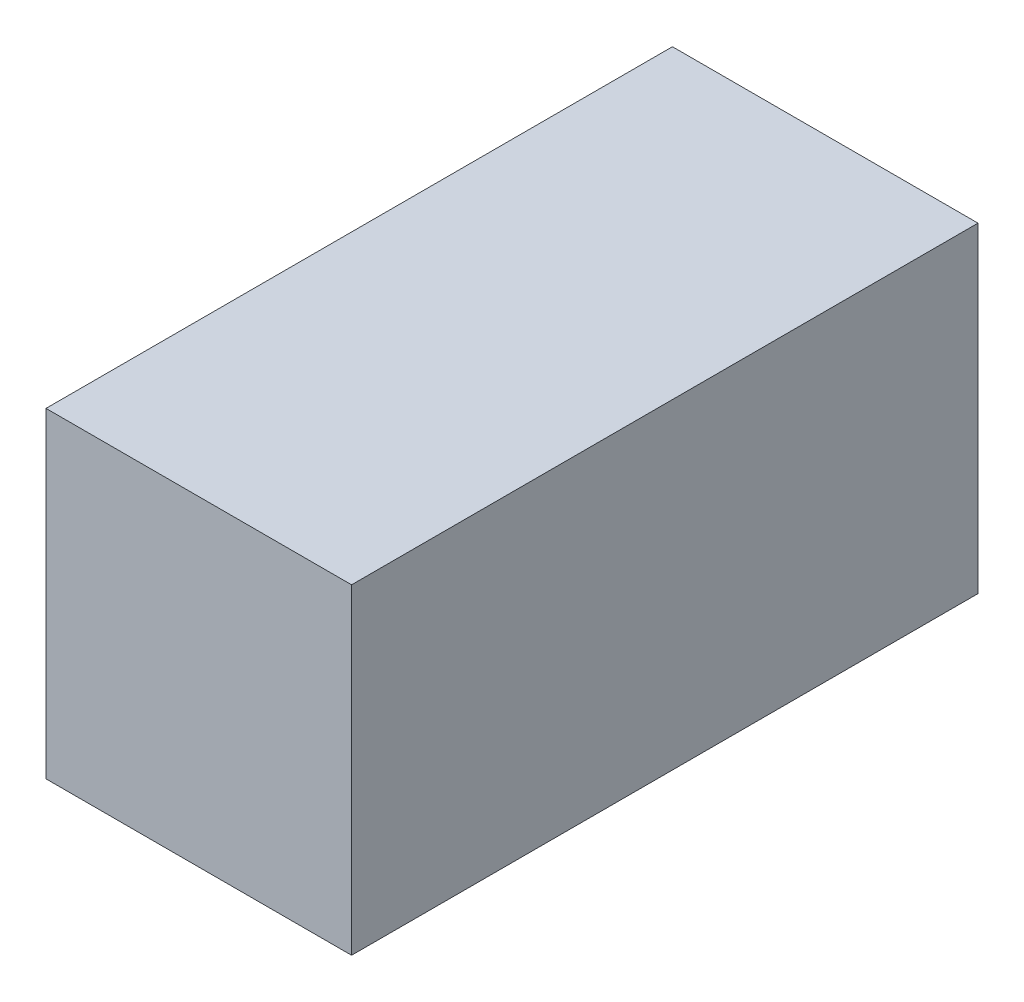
ISO-10303-21;
HEADER;
FILE_DESCRIPTION(('STEP AP214'),'2;1');
FILE_NAME('part.step','',(''),(''),'','','');
FILE_SCHEMA(('AUTOMOTIVE_DESIGN { 1 0 10303 214 1 1 1 1 }'));
ENDSEC;
DATA;
#1=APPLICATION_CONTEXT('core data for automotive mechanical design processes');
#2=APPLICATION_PROTOCOL_DEFINITION('international standard','automotive_design',2000,#1);
#3=PRODUCT_CONTEXT('',#1,'mechanical');
#4=PRODUCT('Part','Part','',(#3));
#5=PRODUCT_RELATED_PRODUCT_CATEGORY('part','',(#4));
#6=PRODUCT_DEFINITION_FORMATION('','',#4);
#7=PRODUCT_DEFINITION_CONTEXT('part definition',#1,'design');
#8=PRODUCT_DEFINITION('design','',#6,#7);
#9=PRODUCT_DEFINITION_SHAPE('','',#8);
#10=(LENGTH_UNIT() NAMED_UNIT(*) SI_UNIT(.MILLI.,.METRE.));
#11=(NAMED_UNIT(*) PLANE_ANGLE_UNIT() SI_UNIT($,.RADIAN.));
#12=(NAMED_UNIT(*) SI_UNIT($,.STERADIAN.) SOLID_ANGLE_UNIT());
#13=UNCERTAINTY_MEASURE_WITH_UNIT(LENGTH_MEASURE(1.E-05),#10,'distance_accuracy_value','');
#14=(GEOMETRIC_REPRESENTATION_CONTEXT(3) GLOBAL_UNCERTAINTY_ASSIGNED_CONTEXT((#13)) GLOBAL_UNIT_ASSIGNED_CONTEXT((#10,
#11,#12)) REPRESENTATION_CONTEXT('',''));
#15=CARTESIAN_POINT('',(0.,0.,0.));
#16=DIRECTION('',(0.,0.,1.));
#17=DIRECTION('',(1.,0.,0.));
#18=AXIS2_PLACEMENT_3D('',#15,#16,#17);
#19=CARTESIAN_POINT('',(1.,2.1,2.05));
#20=DIRECTION('',(-1.,0.,0.));
#21=DIRECTION('',(0.,0.,1.));
#22=AXIS2_PLACEMENT_3D('',#19,#20,#21);
#23=PLANE('',#22);
#24=DIRECTION('',(0.,0.,-1.));
#25=VECTOR('',#24,1.);
#26=CARTESIAN_POINT('',(1.,0.,2.05));
#27=LINE('',#26,#25);
#28=CARTESIAN_POINT('',(1.,0.,2.05));
#29=VERTEX_POINT('',#28);
#30=CARTESIAN_POINT('',(1.,0.,-2.05));
#31=VERTEX_POINT('',#30);
#32=EDGE_CURVE('E102',#29,#31,#27,.T.);
#33=ORIENTED_EDGE('',*,*,#32,.T.);
#34=DIRECTION('',(0.,-1.,0.));
#35=VECTOR('',#34,1.);
#36=CARTESIAN_POINT('',(1.,2.1,-2.05));
#37=LINE('',#36,#35);
#38=CARTESIAN_POINT('',(1.,2.1,-2.05));
#39=VERTEX_POINT('',#38);
#40=EDGE_CURVE('E11',#39,#31,#37,.T.);
#41=ORIENTED_EDGE('',*,*,#40,.F.);
#42=DIRECTION('',(0.,0.,-1.));
#43=VECTOR('',#42,1.);
#44=CARTESIAN_POINT('',(1.,2.1,2.05));
#45=LINE('',#44,#43);
#46=CARTESIAN_POINT('',(1.,2.1,2.05));
#47=VERTEX_POINT('',#46);
#48=EDGE_CURVE('E90',#47,#39,#45,.T.);
#49=ORIENTED_EDGE('',*,*,#48,.F.);
#50=DIRECTION('',(0.,-1.,0.));
#51=VECTOR('',#50,1.);
#52=CARTESIAN_POINT('',(1.,2.1,2.05));
#53=LINE('',#52,#51);
#54=EDGE_CURVE('E98',#47,#29,#53,.T.);
#55=ORIENTED_EDGE('',*,*,#54,.T.);
#56=EDGE_LOOP('',(#33,#41,#49,#55));
#57=FACE_BOUND('',#56,.T.);
#58=ADVANCED_FACE('F39',(#57),#23,.F.);
#59=CARTESIAN_POINT('',(-1.,2.1,-2.05));
#60=DIRECTION('',(0.,0.,1.));
#61=DIRECTION('',(1.,0.,0.));
#62=AXIS2_PLACEMENT_3D('',#59,#60,#61);
#63=PLANE('',#62);
#64=DIRECTION('',(-1.,0.,0.));
#65=VECTOR('',#64,1.);
#66=CARTESIAN_POINT('',(-1.,0.,-2.05));
#67=LINE('',#66,#65);
#68=CARTESIAN_POINT('',(-1.,0.,-2.05));
#69=VERTEX_POINT('',#68);
#70=EDGE_CURVE('E94',#31,#69,#67,.T.);
#71=ORIENTED_EDGE('',*,*,#70,.T.);
#72=DIRECTION('',(0.,-1.,0.));
#73=VECTOR('',#72,1.);
#74=CARTESIAN_POINT('',(-1.,2.1,-2.05));
#75=LINE('',#74,#73);
#76=CARTESIAN_POINT('',(-1.,2.1,-2.05));
#77=VERTEX_POINT('',#76);
#78=EDGE_CURVE('E47',#77,#69,#75,.T.);
#79=ORIENTED_EDGE('',*,*,#78,.F.);
#80=DIRECTION('',(-1.,0.,0.));
#81=VECTOR('',#80,1.);
#82=CARTESIAN_POINT('',(-1.,2.1,-2.05));
#83=LINE('',#82,#81);
#84=EDGE_CURVE('E85',#39,#77,#83,.T.);
#85=ORIENTED_EDGE('',*,*,#84,.F.);
#86=ORIENTED_EDGE('',*,*,#40,.T.);
#87=EDGE_LOOP('',(#71,#79,#85,#86));
#88=FACE_BOUND('',#87,.T.);
#89=ADVANCED_FACE('F93',(#88),#63,.F.);
#90=CARTESIAN_POINT('',(-1.,2.1,2.05));
#91=DIRECTION('',(1.,0.,0.));
#92=DIRECTION('',(0.,0.,-1.));
#93=AXIS2_PLACEMENT_3D('',#90,#91,#92);
#94=PLANE('',#93);
#95=DIRECTION('',(0.,0.,1.));
#96=VECTOR('',#95,1.);
#97=CARTESIAN_POINT('',(-1.,0.,2.05));
#98=LINE('',#97,#96);
#99=CARTESIAN_POINT('',(-1.,0.,2.05));
#100=VERTEX_POINT('',#99);
#101=EDGE_CURVE('E72',#69,#100,#98,.T.);
#102=ORIENTED_EDGE('',*,*,#101,.T.);
#103=DIRECTION('',(0.,-1.,0.));
#104=VECTOR('',#103,1.);
#105=CARTESIAN_POINT('',(-1.,2.1,2.05));
#106=LINE('',#105,#104);
#107=CARTESIAN_POINT('',(-1.,2.1,2.05));
#108=VERTEX_POINT('',#107);
#109=EDGE_CURVE('E95',#108,#100,#106,.T.);
#110=ORIENTED_EDGE('',*,*,#109,.F.);
#111=DIRECTION('',(0.,0.,1.));
#112=VECTOR('',#111,1.);
#113=CARTESIAN_POINT('',(-1.,2.1,2.05));
#114=LINE('',#113,#112);
#115=EDGE_CURVE('E88',#77,#108,#114,.T.);
#116=ORIENTED_EDGE('',*,*,#115,.F.);
#117=ORIENTED_EDGE('',*,*,#78,.T.);
#118=EDGE_LOOP('',(#102,#110,#116,#117));
#119=FACE_BOUND('',#118,.T.);
#120=ADVANCED_FACE('F96',(#119),#94,.F.);
#121=CARTESIAN_POINT('',(-1.,2.1,2.05));
#122=DIRECTION('',(0.,0.,-1.));
#123=DIRECTION('',(-1.,0.,0.));
#124=AXIS2_PLACEMENT_3D('',#121,#122,#123);
#125=PLANE('',#124);
#126=DIRECTION('',(1.,0.,0.));
#127=VECTOR('',#126,1.);
#128=CARTESIAN_POINT('',(-1.,0.,2.05));
#129=LINE('',#128,#127);
#130=EDGE_CURVE('E78',#100,#29,#129,.T.);
#131=ORIENTED_EDGE('',*,*,#130,.T.);
#132=ORIENTED_EDGE('',*,*,#54,.F.);
#133=DIRECTION('',(1.,0.,0.));
#134=VECTOR('',#133,1.);
#135=CARTESIAN_POINT('',(-1.,2.1,2.05));
#136=LINE('',#135,#134);
#137=EDGE_CURVE('E55',#108,#47,#136,.T.);
#138=ORIENTED_EDGE('',*,*,#137,.F.);
#139=ORIENTED_EDGE('',*,*,#109,.T.);
#140=EDGE_LOOP('',(#131,#132,#138,#139));
#141=FACE_BOUND('',#140,.T.);
#142=ADVANCED_FACE('F109',(#141),#125,.F.);
#143=CARTESIAN_POINT('',(0.,2.1,0.));
#144=DIRECTION('',(0.,-1.,0.));
#145=DIRECTION('',(0.,0.,-1.));
#146=AXIS2_PLACEMENT_3D('',#143,#144,#145);
#147=PLANE('',#146);
#148=ORIENTED_EDGE('',*,*,#48,.T.);
#149=ORIENTED_EDGE('',*,*,#84,.T.);
#150=ORIENTED_EDGE('',*,*,#115,.T.);
#151=ORIENTED_EDGE('',*,*,#137,.T.);
#152=EDGE_LOOP('',(#148,#149,#150,#151));
#153=FACE_BOUND('',#152,.T.);
#154=ADVANCED_FACE('F86',(#153),#147,.F.);
#155=CARTESIAN_POINT('',(0.,0.,0.));
#156=DIRECTION('',(0.,-1.,0.));
#157=DIRECTION('',(0.,0.,-1.));
#158=AXIS2_PLACEMENT_3D('',#155,#156,#157);
#159=PLANE('',#158);
#160=ORIENTED_EDGE('',*,*,#32,.F.);
#161=ORIENTED_EDGE('',*,*,#130,.F.);
#162=ORIENTED_EDGE('',*,*,#101,.F.);
#163=ORIENTED_EDGE('',*,*,#70,.F.);
#164=EDGE_LOOP('',(#160,#161,#162,#163));
#165=FACE_BOUND('',#164,.T.);
#166=ADVANCED_FACE('F112',(#165),#159,.T.);
#167=CLOSED_SHELL('',(#58,#89,#120,#142,#154,#166));
#168=MANIFOLD_SOLID_BREP('B2',#167);
#169=ADVANCED_BREP_SHAPE_REPRESENTATION('',(#18,#168),#14);
#170=SHAPE_DEFINITION_REPRESENTATION(#9,#169);
ENDSEC;
END-ISO-10303-21;
